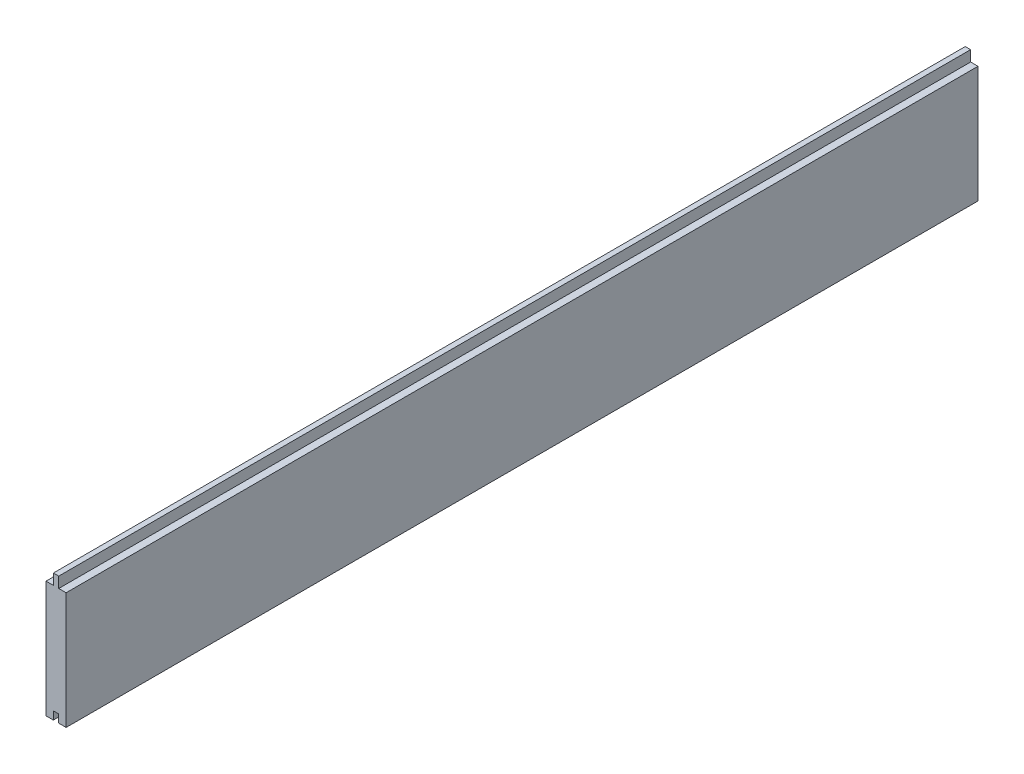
ISO-10303-21;
HEADER;
FILE_DESCRIPTION(('STEP AP214'),'2;1');
FILE_NAME('part.step','',(''),(''),'','','');
FILE_SCHEMA(('AUTOMOTIVE_DESIGN { 1 0 10303 214 1 1 1 1 }'));
ENDSEC;
DATA;
#1=APPLICATION_CONTEXT('core data for automotive mechanical design processes');
#2=APPLICATION_PROTOCOL_DEFINITION('international standard','automotive_design',2000,#1);
#3=PRODUCT_CONTEXT('',#1,'mechanical');
#4=PRODUCT('Part','Part','',(#3));
#5=PRODUCT_RELATED_PRODUCT_CATEGORY('part','',(#4));
#6=PRODUCT_DEFINITION_FORMATION('','',#4);
#7=PRODUCT_DEFINITION_CONTEXT('part definition',#1,'design');
#8=PRODUCT_DEFINITION('design','',#6,#7);
#9=PRODUCT_DEFINITION_SHAPE('','',#8);
#10=(LENGTH_UNIT() NAMED_UNIT(*) SI_UNIT(.MILLI.,.METRE.));
#11=(NAMED_UNIT(*) PLANE_ANGLE_UNIT() SI_UNIT($,.RADIAN.));
#12=(NAMED_UNIT(*) SI_UNIT($,.STERADIAN.) SOLID_ANGLE_UNIT());
#13=UNCERTAINTY_MEASURE_WITH_UNIT(LENGTH_MEASURE(1.E-05),#10,'distance_accuracy_value','');
#14=(GEOMETRIC_REPRESENTATION_CONTEXT(3) GLOBAL_UNCERTAINTY_ASSIGNED_CONTEXT((#13)) GLOBAL_UNIT_ASSIGNED_CONTEXT((#10,
#11,#12)) REPRESENTATION_CONTEXT('',''));
#15=CARTESIAN_POINT('',(0.,0.,0.));
#16=DIRECTION('',(0.,0.,1.));
#17=DIRECTION('',(1.,0.,0.));
#18=AXIS2_PLACEMENT_3D('',#15,#16,#17);
#19=CARTESIAN_POINT('',(1.99999999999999,0.,680.));
#20=DIRECTION('',(1.,0.,0.));
#21=DIRECTION('',(0.,1.,0.));
#22=AXIS2_PLACEMENT_3D('',#19,#20,#21);
#23=PLANE('',#22);
#24=DIRECTION('',(0.,-1.,0.));
#25=VECTOR('',#24,1.);
#26=CARTESIAN_POINT('',(1.99999999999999,0.,0.));
#27=LINE('',#26,#25);
#28=CARTESIAN_POINT('',(2.,-37.5,0.));
#29=VERTEX_POINT('',#28);
#30=CARTESIAN_POINT('',(2.,-43.5,0.));
#31=VERTEX_POINT('',#30);
#32=EDGE_CURVE('E215',#29,#31,#27,.T.);
#33=ORIENTED_EDGE('',*,*,#32,.T.);
#34=DIRECTION('',(0.,0.,-1.));
#35=VECTOR('',#34,1.);
#36=CARTESIAN_POINT('',(2.,-43.5,680.));
#37=LINE('',#36,#35);
#38=CARTESIAN_POINT('',(2.,-43.5,680.));
#39=VERTEX_POINT('',#38);
#40=EDGE_CURVE('E90',#39,#31,#37,.T.);
#41=ORIENTED_EDGE('',*,*,#40,.F.);
#42=DIRECTION('',(0.,-1.,0.));
#43=VECTOR('',#42,1.);
#44=CARTESIAN_POINT('',(1.99999999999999,0.,680.));
#45=LINE('',#44,#43);
#46=CARTESIAN_POINT('',(2.,-37.5,680.));
#47=VERTEX_POINT('',#46);
#48=EDGE_CURVE('E234',#47,#39,#45,.T.);
#49=ORIENTED_EDGE('',*,*,#48,.F.);
#50=DIRECTION('',(0.,0.,-1.));
#51=VECTOR('',#50,1.);
#52=CARTESIAN_POINT('',(2.,-37.5,680.));
#53=LINE('',#52,#51);
#54=EDGE_CURVE('E12',#47,#29,#53,.T.);
#55=ORIENTED_EDGE('',*,*,#54,.T.);
#56=EDGE_LOOP('',(#33,#41,#49,#55));
#57=FACE_BOUND('',#56,.T.);
#58=ADVANCED_FACE('F80',(#57),#23,.F.);
#59=CARTESIAN_POINT('',(0.,-43.5,680.));
#60=DIRECTION('',(0.,1.,0.));
#61=DIRECTION('',(0.,0.,1.));
#62=AXIS2_PLACEMENT_3D('',#59,#60,#61);
#63=PLANE('',#62);
#64=DIRECTION('',(1.,0.,0.));
#65=VECTOR('',#64,1.);
#66=CARTESIAN_POINT('',(0.,-43.5,0.));
#67=LINE('',#66,#65);
#68=CARTESIAN_POINT('',(7.5,-43.5,0.));
#69=VERTEX_POINT('',#68);
#70=EDGE_CURVE('E212',#31,#69,#67,.T.);
#71=ORIENTED_EDGE('',*,*,#70,.T.);
#72=DIRECTION('',(0.,0.,-1.));
#73=VECTOR('',#72,1.);
#74=CARTESIAN_POINT('',(7.5,-43.5,680.));
#75=LINE('',#74,#73);
#76=CARTESIAN_POINT('',(7.5,-43.5,680.));
#77=VERTEX_POINT('',#76);
#78=EDGE_CURVE('E182',#77,#69,#75,.T.);
#79=ORIENTED_EDGE('',*,*,#78,.F.);
#80=DIRECTION('',(1.,0.,0.));
#81=VECTOR('',#80,1.);
#82=CARTESIAN_POINT('',(0.,-43.5,680.));
#83=LINE('',#82,#81);
#84=EDGE_CURVE('E231',#39,#77,#83,.T.);
#85=ORIENTED_EDGE('',*,*,#84,.F.);
#86=ORIENTED_EDGE('',*,*,#40,.T.);
#87=EDGE_LOOP('',(#71,#79,#85,#86));
#88=FACE_BOUND('',#87,.T.);
#89=ADVANCED_FACE('F257',(#88),#63,.F.);
#90=CARTESIAN_POINT('',(7.5,0.,680.));
#91=DIRECTION('',(1.,0.,0.));
#92=DIRECTION('',(0.,1.,0.));
#93=AXIS2_PLACEMENT_3D('',#90,#91,#92);
#94=PLANE('',#93);
#95=DIRECTION('',(0.,-1.,0.));
#96=VECTOR('',#95,1.);
#97=CARTESIAN_POINT('',(7.5,0.,0.));
#98=LINE('',#97,#96);
#99=CARTESIAN_POINT('',(7.49999999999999,43.5,0.));
#100=VERTEX_POINT('',#99);
#101=EDGE_CURVE('E209',#100,#69,#98,.T.);
#102=ORIENTED_EDGE('',*,*,#101,.F.);
#103=DIRECTION('',(0.,0.,-1.));
#104=VECTOR('',#103,1.);
#105=CARTESIAN_POINT('',(7.49999999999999,43.5,680.));
#106=LINE('',#105,#104);
#107=CARTESIAN_POINT('',(7.49999999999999,43.5,680.));
#108=VERTEX_POINT('',#107);
#109=EDGE_CURVE('E184',#108,#100,#106,.T.);
#110=ORIENTED_EDGE('',*,*,#109,.F.);
#111=DIRECTION('',(0.,-1.,0.));
#112=VECTOR('',#111,1.);
#113=CARTESIAN_POINT('',(7.5,0.,680.));
#114=LINE('',#113,#112);
#115=EDGE_CURVE('E228',#108,#77,#114,.T.);
#116=ORIENTED_EDGE('',*,*,#115,.T.);
#117=ORIENTED_EDGE('',*,*,#78,.T.);
#118=EDGE_LOOP('',(#102,#110,#116,#117));
#119=FACE_BOUND('',#118,.T.);
#120=ADVANCED_FACE('F305',(#119),#94,.T.);
#121=CARTESIAN_POINT('',(0.,43.5,680.));
#122=DIRECTION('',(0.,1.,0.));
#123=DIRECTION('',(0.,0.,1.));
#124=AXIS2_PLACEMENT_3D('',#121,#122,#123);
#125=PLANE('',#124);
#126=DIRECTION('',(1.,0.,0.));
#127=VECTOR('',#126,1.);
#128=CARTESIAN_POINT('',(0.,43.5,0.));
#129=LINE('',#128,#127);
#130=CARTESIAN_POINT('',(1.99999999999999,43.5,0.));
#131=VERTEX_POINT('',#130);
#132=EDGE_CURVE('E206',#131,#100,#129,.T.);
#133=ORIENTED_EDGE('',*,*,#132,.F.);
#134=DIRECTION('',(0.,0.,-1.));
#135=VECTOR('',#134,1.);
#136=CARTESIAN_POINT('',(1.99999999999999,43.5,680.));
#137=LINE('',#136,#135);
#138=CARTESIAN_POINT('',(1.99999999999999,43.5,680.));
#139=VERTEX_POINT('',#138);
#140=EDGE_CURVE('E186',#139,#131,#137,.T.);
#141=ORIENTED_EDGE('',*,*,#140,.F.);
#142=DIRECTION('',(1.,0.,0.));
#143=VECTOR('',#142,1.);
#144=CARTESIAN_POINT('',(0.,43.5,680.));
#145=LINE('',#144,#143);
#146=EDGE_CURVE('E225',#139,#108,#145,.T.);
#147=ORIENTED_EDGE('',*,*,#146,.T.);
#148=ORIENTED_EDGE('',*,*,#109,.T.);
#149=EDGE_LOOP('',(#133,#141,#147,#148));
#150=FACE_BOUND('',#149,.T.);
#151=ADVANCED_FACE('F308',(#150),#125,.T.);
#152=CARTESIAN_POINT('',(-7.50000000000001,43.5,0.));
#153=VERTEX_POINT('',#152);
#154=CARTESIAN_POINT('',(-2.00000000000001,43.5,0.));
#155=VERTEX_POINT('',#154);
#156=EDGE_CURVE('E168',#153,#155,#129,.T.);
#157=ORIENTED_EDGE('',*,*,#156,.F.);
#158=DIRECTION('',(0.,0.,-1.));
#159=VECTOR('',#158,1.);
#160=CARTESIAN_POINT('',(-7.50000000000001,43.5,680.));
#161=LINE('',#160,#159);
#162=CARTESIAN_POINT('',(-7.50000000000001,43.5,680.));
#163=VERTEX_POINT('',#162);
#164=EDGE_CURVE('E190',#163,#153,#161,.T.);
#165=ORIENTED_EDGE('',*,*,#164,.F.);
#166=CARTESIAN_POINT('',(-2.00000000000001,43.5,680.));
#167=VERTEX_POINT('',#166);
#168=EDGE_CURVE('E224',#163,#167,#145,.T.);
#169=ORIENTED_EDGE('',*,*,#168,.T.);
#170=DIRECTION('',(0.,0.,-1.));
#171=VECTOR('',#170,1.);
#172=CARTESIAN_POINT('',(-2.00000000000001,43.5,680.));
#173=LINE('',#172,#171);
#174=EDGE_CURVE('E188',#167,#155,#173,.T.);
#175=ORIENTED_EDGE('',*,*,#174,.T.);
#176=EDGE_LOOP('',(#157,#165,#169,#175));
#177=FACE_BOUND('',#176,.T.);
#178=ADVANCED_FACE('F310',(#177),#125,.T.);
#179=CARTESIAN_POINT('',(-7.5,0.,680.));
#180=DIRECTION('',(1.,0.,0.));
#181=DIRECTION('',(0.,1.,0.));
#182=AXIS2_PLACEMENT_3D('',#179,#180,#181);
#183=PLANE('',#182);
#184=DIRECTION('',(0.,-1.,0.));
#185=VECTOR('',#184,1.);
#186=CARTESIAN_POINT('',(-7.5,0.,0.));
#187=LINE('',#186,#185);
#188=CARTESIAN_POINT('',(-7.5,-43.5,0.));
#189=VERTEX_POINT('',#188);
#190=EDGE_CURVE('E204',#153,#189,#187,.T.);
#191=ORIENTED_EDGE('',*,*,#190,.T.);
#192=DIRECTION('',(0.,0.,-1.));
#193=VECTOR('',#192,1.);
#194=CARTESIAN_POINT('',(-7.5,-43.5,680.));
#195=LINE('',#194,#193);
#196=CARTESIAN_POINT('',(-7.5,-43.5,680.));
#197=VERTEX_POINT('',#196);
#198=EDGE_CURVE('E192',#197,#189,#195,.T.);
#199=ORIENTED_EDGE('',*,*,#198,.F.);
#200=DIRECTION('',(0.,-1.,0.));
#201=VECTOR('',#200,1.);
#202=CARTESIAN_POINT('',(-7.5,0.,680.));
#203=LINE('',#202,#201);
#204=EDGE_CURVE('E221',#163,#197,#203,.T.);
#205=ORIENTED_EDGE('',*,*,#204,.F.);
#206=ORIENTED_EDGE('',*,*,#164,.T.);
#207=EDGE_LOOP('',(#191,#199,#205,#206));
#208=FACE_BOUND('',#207,.T.);
#209=ADVANCED_FACE('F278',(#208),#183,.F.);
#210=CARTESIAN_POINT('',(-2.,-43.5,0.));
#211=VERTEX_POINT('',#210);
#212=EDGE_CURVE('E203',#189,#211,#67,.T.);
#213=ORIENTED_EDGE('',*,*,#212,.T.);
#214=DIRECTION('',(0.,0.,-1.));
#215=VECTOR('',#214,1.);
#216=CARTESIAN_POINT('',(-2.,-43.5,680.));
#217=LINE('',#216,#215);
#218=CARTESIAN_POINT('',(-2.,-43.5,680.));
#219=VERTEX_POINT('',#218);
#220=EDGE_CURVE('E195',#219,#211,#217,.T.);
#221=ORIENTED_EDGE('',*,*,#220,.F.);
#222=EDGE_CURVE('E220',#197,#219,#83,.T.);
#223=ORIENTED_EDGE('',*,*,#222,.F.);
#224=ORIENTED_EDGE('',*,*,#198,.T.);
#225=EDGE_LOOP('',(#213,#221,#223,#224));
#226=FACE_BOUND('',#225,.T.);
#227=ADVANCED_FACE('F282',(#226),#63,.F.);
#228=CARTESIAN_POINT('',(-2.00000000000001,0.,680.));
#229=DIRECTION('',(1.,0.,0.));
#230=DIRECTION('',(0.,1.,0.));
#231=AXIS2_PLACEMENT_3D('',#228,#229,#230);
#232=PLANE('',#231);
#233=DIRECTION('',(0.,-1.,0.));
#234=VECTOR('',#233,1.);
#235=CARTESIAN_POINT('',(-2.00000000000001,0.,0.));
#236=LINE('',#235,#234);
#237=CARTESIAN_POINT('',(-2.,-37.5,0.));
#238=VERTEX_POINT('',#237);
#239=EDGE_CURVE('E199',#238,#211,#236,.T.);
#240=ORIENTED_EDGE('',*,*,#239,.F.);
#241=DIRECTION('',(0.,0.,-1.));
#242=VECTOR('',#241,1.);
#243=CARTESIAN_POINT('',(-2.,-37.5,680.));
#244=LINE('',#243,#242);
#245=CARTESIAN_POINT('',(-2.,-37.5,680.));
#246=VERTEX_POINT('',#245);
#247=EDGE_CURVE('E99',#246,#238,#244,.T.);
#248=ORIENTED_EDGE('',*,*,#247,.F.);
#249=DIRECTION('',(0.,-1.,0.));
#250=VECTOR('',#249,1.);
#251=CARTESIAN_POINT('',(-2.00000000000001,0.,680.));
#252=LINE('',#251,#250);
#253=EDGE_CURVE('E198',#246,#219,#252,.T.);
#254=ORIENTED_EDGE('',*,*,#253,.T.);
#255=ORIENTED_EDGE('',*,*,#220,.T.);
#256=EDGE_LOOP('',(#240,#248,#254,#255));
#257=FACE_BOUND('',#256,.T.);
#258=ADVANCED_FACE('F283',(#257),#232,.T.);
#259=CARTESIAN_POINT('',(0.,-37.5,680.));
#260=DIRECTION('',(0.,1.,0.));
#261=DIRECTION('',(0.,0.,1.));
#262=AXIS2_PLACEMENT_3D('',#259,#260,#261);
#263=PLANE('',#262);
#264=DIRECTION('',(1.,0.,0.));
#265=VECTOR('',#264,1.);
#266=CARTESIAN_POINT('',(0.,-37.5,0.));
#267=LINE('',#266,#265);
#268=EDGE_CURVE('E160',#238,#29,#267,.T.);
#269=ORIENTED_EDGE('',*,*,#268,.T.);
#270=ORIENTED_EDGE('',*,*,#54,.F.);
#271=DIRECTION('',(1.,0.,0.));
#272=VECTOR('',#271,1.);
#273=CARTESIAN_POINT('',(0.,-37.5,680.));
#274=LINE('',#273,#272);
#275=EDGE_CURVE('E202',#246,#47,#274,.T.);
#276=ORIENTED_EDGE('',*,*,#275,.F.);
#277=ORIENTED_EDGE('',*,*,#247,.T.);
#278=EDGE_LOOP('',(#269,#270,#276,#277));
#279=FACE_BOUND('',#278,.T.);
#280=ADVANCED_FACE('F248',(#279),#263,.F.);
#281=CARTESIAN_POINT('',(0.,0.,0.));
#282=DIRECTION('',(0.,0.,1.));
#283=DIRECTION('',(1.,0.,0.));
#284=AXIS2_PLACEMENT_3D('',#281,#282,#283);
#285=PLANE('',#284);
#286=DIRECTION('',(0.,-1.,0.));
#287=VECTOR('',#286,1.);
#288=CARTESIAN_POINT('',(1.99999999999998,51.5,0.));
#289=LINE('',#288,#287);
#290=CARTESIAN_POINT('',(1.99999999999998,51.5,0.));
#291=VERTEX_POINT('',#290);
#292=EDGE_CURVE('E170',#291,#131,#289,.T.);
#293=ORIENTED_EDGE('',*,*,#292,.T.);
#294=ORIENTED_EDGE('',*,*,#132,.T.);
#295=ORIENTED_EDGE('',*,*,#101,.T.);
#296=ORIENTED_EDGE('',*,*,#70,.F.);
#297=ORIENTED_EDGE('',*,*,#32,.F.);
#298=ORIENTED_EDGE('',*,*,#268,.F.);
#299=ORIENTED_EDGE('',*,*,#239,.T.);
#300=ORIENTED_EDGE('',*,*,#212,.F.);
#301=ORIENTED_EDGE('',*,*,#190,.F.);
#302=ORIENTED_EDGE('',*,*,#156,.T.);
#303=DIRECTION('',(0.,-1.,0.));
#304=VECTOR('',#303,1.);
#305=CARTESIAN_POINT('',(-2.00000000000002,51.5,0.));
#306=LINE('',#305,#304);
#307=CARTESIAN_POINT('',(-2.00000000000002,51.5,0.));
#308=VERTEX_POINT('',#307);
#309=EDGE_CURVE('E155',#308,#155,#306,.T.);
#310=ORIENTED_EDGE('',*,*,#309,.F.);
#311=DIRECTION('',(1.,0.,0.));
#312=VECTOR('',#311,1.);
#313=CARTESIAN_POINT('',(-2.00000000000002,51.5,0.));
#314=LINE('',#313,#312);
#315=EDGE_CURVE('E165',#308,#291,#314,.T.);
#316=ORIENTED_EDGE('',*,*,#315,.T.);
#317=EDGE_LOOP('',(#293,#294,#295,#296,#297,#298,#299,#300,#301,#302,#310,#316));
#318=FACE_BOUND('',#317,.T.);
#319=ADVANCED_FACE('F164',(#318),#285,.F.);
#320=CARTESIAN_POINT('',(0.,0.,680.));
#321=DIRECTION('',(0.,0.,1.));
#322=DIRECTION('',(1.,0.,0.));
#323=AXIS2_PLACEMENT_3D('',#320,#321,#322);
#324=PLANE('',#323);
#325=ORIENTED_EDGE('',*,*,#146,.F.);
#326=DIRECTION('',(0.,-1.,0.));
#327=VECTOR('',#326,1.);
#328=CARTESIAN_POINT('',(1.99999999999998,51.5,680.));
#329=LINE('',#328,#327);
#330=CARTESIAN_POINT('',(1.99999999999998,51.5,680.));
#331=VERTEX_POINT('',#330);
#332=EDGE_CURVE('E176',#331,#139,#329,.T.);
#333=ORIENTED_EDGE('',*,*,#332,.F.);
#334=DIRECTION('',(1.,0.,0.));
#335=VECTOR('',#334,1.);
#336=CARTESIAN_POINT('',(-2.00000000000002,51.5,680.));
#337=LINE('',#336,#335);
#338=CARTESIAN_POINT('',(-2.00000000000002,51.5,680.));
#339=VERTEX_POINT('',#338);
#340=EDGE_CURVE('E169',#339,#331,#337,.T.);
#341=ORIENTED_EDGE('',*,*,#340,.F.);
#342=DIRECTION('',(0.,-1.,0.));
#343=VECTOR('',#342,1.);
#344=CARTESIAN_POINT('',(-2.00000000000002,51.5,680.));
#345=LINE('',#344,#343);
#346=EDGE_CURVE('E158',#339,#167,#345,.T.);
#347=ORIENTED_EDGE('',*,*,#346,.T.);
#348=ORIENTED_EDGE('',*,*,#168,.F.);
#349=ORIENTED_EDGE('',*,*,#204,.T.);
#350=ORIENTED_EDGE('',*,*,#222,.T.);
#351=ORIENTED_EDGE('',*,*,#253,.F.);
#352=ORIENTED_EDGE('',*,*,#275,.T.);
#353=ORIENTED_EDGE('',*,*,#48,.T.);
#354=ORIENTED_EDGE('',*,*,#84,.T.);
#355=ORIENTED_EDGE('',*,*,#115,.F.);
#356=EDGE_LOOP('',(#325,#333,#341,#347,#348,#349,#350,#351,#352,#353,#354,#355));
#357=FACE_BOUND('',#356,.T.);
#358=ADVANCED_FACE('F242',(#357),#324,.T.);
#359=CARTESIAN_POINT('',(-2.00000000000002,51.5,680.));
#360=DIRECTION('',(1.,0.,0.));
#361=DIRECTION('',(0.,1.,0.));
#362=AXIS2_PLACEMENT_3D('',#359,#360,#361);
#363=PLANE('',#362);
#364=ORIENTED_EDGE('',*,*,#174,.F.);
#365=ORIENTED_EDGE('',*,*,#346,.F.);
#366=DIRECTION('',(0.,0.,-1.));
#367=VECTOR('',#366,1.);
#368=CARTESIAN_POINT('',(-2.00000000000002,51.5,680.));
#369=LINE('',#368,#367);
#370=EDGE_CURVE('E151',#339,#308,#369,.T.);
#371=ORIENTED_EDGE('',*,*,#370,.T.);
#372=ORIENTED_EDGE('',*,*,#309,.T.);
#373=EDGE_LOOP('',(#364,#365,#371,#372));
#374=FACE_BOUND('',#373,.T.);
#375=ADVANCED_FACE('F154',(#374),#363,.F.);
#376=CARTESIAN_POINT('',(1.99999999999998,51.5,680.));
#377=DIRECTION('',(1.,0.,0.));
#378=DIRECTION('',(0.,1.,0.));
#379=AXIS2_PLACEMENT_3D('',#376,#377,#378);
#380=PLANE('',#379);
#381=ORIENTED_EDGE('',*,*,#332,.T.);
#382=ORIENTED_EDGE('',*,*,#140,.T.);
#383=ORIENTED_EDGE('',*,*,#292,.F.);
#384=DIRECTION('',(0.,0.,-1.));
#385=VECTOR('',#384,1.);
#386=CARTESIAN_POINT('',(1.99999999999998,51.5,680.));
#387=LINE('',#386,#385);
#388=EDGE_CURVE('E84',#331,#291,#387,.T.);
#389=ORIENTED_EDGE('',*,*,#388,.F.);
#390=EDGE_LOOP('',(#381,#382,#383,#389));
#391=FACE_BOUND('',#390,.T.);
#392=ADVANCED_FACE('F294',(#391),#380,.T.);
#393=CARTESIAN_POINT('',(-2.00000000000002,51.5,680.));
#394=DIRECTION('',(0.,1.,0.));
#395=DIRECTION('',(0.,0.,1.));
#396=AXIS2_PLACEMENT_3D('',#393,#394,#395);
#397=PLANE('',#396);
#398=ORIENTED_EDGE('',*,*,#315,.F.);
#399=ORIENTED_EDGE('',*,*,#370,.F.);
#400=ORIENTED_EDGE('',*,*,#340,.T.);
#401=ORIENTED_EDGE('',*,*,#388,.T.);
#402=EDGE_LOOP('',(#398,#399,#400,#401));
#403=FACE_BOUND('',#402,.T.);
#404=ADVANCED_FACE('F82',(#403),#397,.T.);
#405=CLOSED_SHELL('',(#58,#89,#120,#151,#178,#209,#227,#258,#280,#319,#358,#375,#392,#404));
#406=MANIFOLD_SOLID_BREP('B2',#405);
#407=ADVANCED_BREP_SHAPE_REPRESENTATION('',(#18,#406),#14);
#408=SHAPE_DEFINITION_REPRESENTATION(#9,#407);
ENDSEC;
END-ISO-10303-21;
